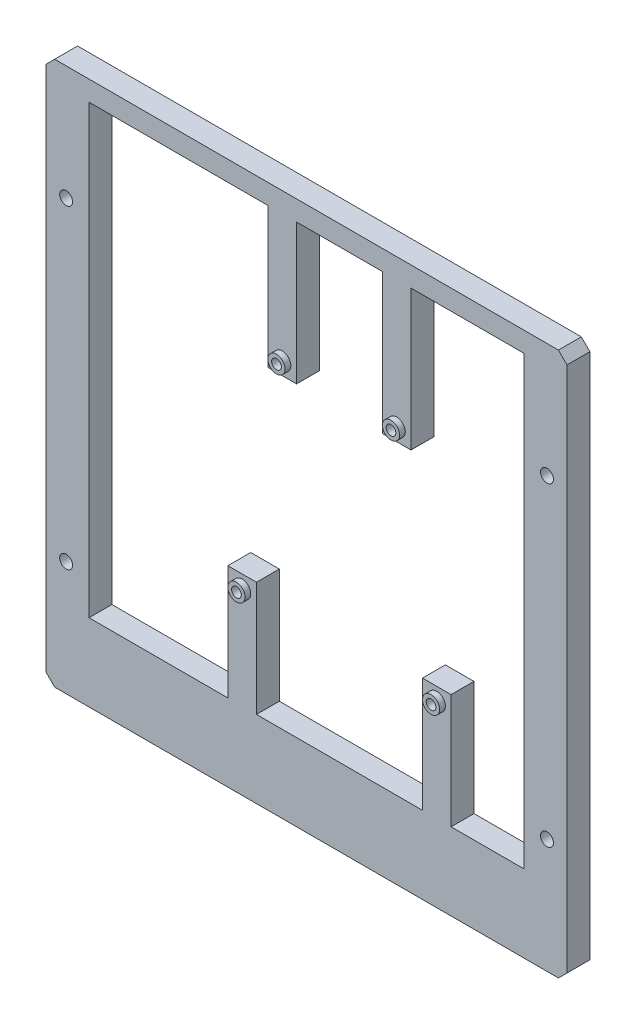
from build123d import *

# Parameters (mm, degrees)
SKETCH_1_R                          = 2.25
SKETCH_1_W                          = 152
SKETCH_1_H                          = 156
COMMON_OPEN_FRAME_M4_HOLES_DEPTH    = 8
SKETCH_2_W                          = 10
SKETCH_2_H                          = 64
SKETCH_2_R                          = 1.7
JOINED_PCB_MOUNT_TAB_1_DEPTH        = 8
SKETCH_3_W                          = 10
SKETCH_3_H                          = 64
SKETCH_3_R                          = 1.7
JOINED_PCB_MOUNT_TAB_2_DEPTH        = 8
SKETCH_4_W                          = 10
SKETCH_4_H                          = 53
SKETCH_4_R                          = 1.7
JOINED_PCB_MOUNT_TAB_3_DEPTH        = 8
SKETCH_5_W                          = 10
SKETCH_5_H                          = 53
SKETCH_5_R                          = 1.7
JOINED_PCB_MOUNT_TAB_4_DEPTH        = 8
FOUR_FRONT_CONTACT_BOSSES_OD6_START = 8
SKETCH_6_R                          = 3
SKETCH_6_R_2                        = 1.7
FOUR_FRONT_CONTACT_BOSSES_OD6_DEPTH = 2


with BuildPart() as part:
    # Sketch 1 → Common_open_frame_M4_holes (new body)
    with BuildSketch(Plane.XY):
        Polygon((-98, -95), (78, -95), (81, -92), (81, 92), (78, 95), (-98, 95), (-101, 92), (-101, -92), align=None)
        with Locations((-94, -55)):
            Circle(SKETCH_1_R, mode=Mode.SUBTRACT)
        with Locations((-94, 55)):
            Circle(SKETCH_1_R, mode=Mode.SUBTRACT)
        with Locations((74, -55)):
            Circle(SKETCH_1_R, mode=Mode.SUBTRACT)
        with Locations((74, 55)):
            Circle(SKETCH_1_R, mode=Mode.SUBTRACT)
        with Locations((-10, 10)):
            Rectangle(SKETCH_1_W, SKETCH_1_H, mode=Mode.SUBTRACT)
    extrude(amount=COMMON_OPEN_FRAME_M4_HOLES_DEPTH)

    # Sketch 2 → Joined_PCB_mount_tab_1 (add)
    with BuildSketch(Plane.XY):
        with Locations((-32.5, -60)):
            Rectangle(SKETCH_2_W, SKETCH_2_H)
        with Locations((-32.5, -32.5)):
            Circle(SKETCH_2_R, mode=Mode.SUBTRACT)
    extrude(amount=JOINED_PCB_MOUNT_TAB_1_DEPTH)

    # Sketch 3 → Joined_PCB_mount_tab_2 (add)
    with BuildSketch(Plane.XY):
        with Locations((35.5, -60)):
            Rectangle(SKETCH_3_W, SKETCH_3_H)
        with Locations((35.5, -32.5)):
            Circle(SKETCH_3_R, mode=Mode.SUBTRACT)
    extrude(amount=JOINED_PCB_MOUNT_TAB_2_DEPTH)

    # Sketch 4 → Joined_PCB_mount_tab_3 (add)
    with BuildSketch(Plane.XY):
        with Locations((21.5, 65.5)):
            Rectangle(SKETCH_4_W, SKETCH_4_H)
        with Locations((21.5, 43.5)):
            Circle(SKETCH_4_R, mode=Mode.SUBTRACT)
    extrude(amount=JOINED_PCB_MOUNT_TAB_3_DEPTH)

    # Sketch 5 → Joined_PCB_mount_tab_4 (add)
    with BuildSketch(Plane.XY):
        with Locations((-18.5, 65.5)):
            Rectangle(SKETCH_5_W, SKETCH_5_H)
        with Locations((-18.5, 43.5)):
            Circle(SKETCH_5_R, mode=Mode.SUBTRACT)
    extrude(amount=JOINED_PCB_MOUNT_TAB_4_DEPTH)

    # Sketch 6 → Four_front_contact_bosses_OD6 (add)
    # profile 1 of 4: a face of its own
    with BuildSketch(Plane.XY.offset(FOUR_FRONT_CONTACT_BOSSES_OD6_START)):
        with Locations((-32.5, -32.5)):
            Circle(SKETCH_6_R)
        with Locations((-32.5, -32.5)):
            Circle(SKETCH_6_R_2, mode=Mode.SUBTRACT)
    # profile 2 of 4: a face of its own
    with BuildSketch(Plane.XY.offset(FOUR_FRONT_CONTACT_BOSSES_OD6_START)):
        with Locations((35.5, -32.5)):
            Circle(SKETCH_6_R)
        with Locations((35.5, -32.5)):
            Circle(SKETCH_6_R_2, mode=Mode.SUBTRACT)
    # profile 3 of 4: a face of its own
    with BuildSketch(Plane.XY.offset(FOUR_FRONT_CONTACT_BOSSES_OD6_START)):
        with Locations((21.5, 43.5)):
            Circle(SKETCH_6_R)
        with Locations((21.5, 43.5)):
            Circle(SKETCH_6_R_2, mode=Mode.SUBTRACT)
    # profile 4 of 4: a face of its own
    with BuildSketch(Plane.XY.offset(FOUR_FRONT_CONTACT_BOSSES_OD6_START)):
        with Locations((-18.5, 43.5)):
            Circle(SKETCH_6_R)
        with Locations((-18.5, 43.5)):
            Circle(SKETCH_6_R_2, mode=Mode.SUBTRACT)
    extrude(amount=FOUR_FRONT_CONTACT_BOSSES_OD6_DEPTH)


solid = part.part
